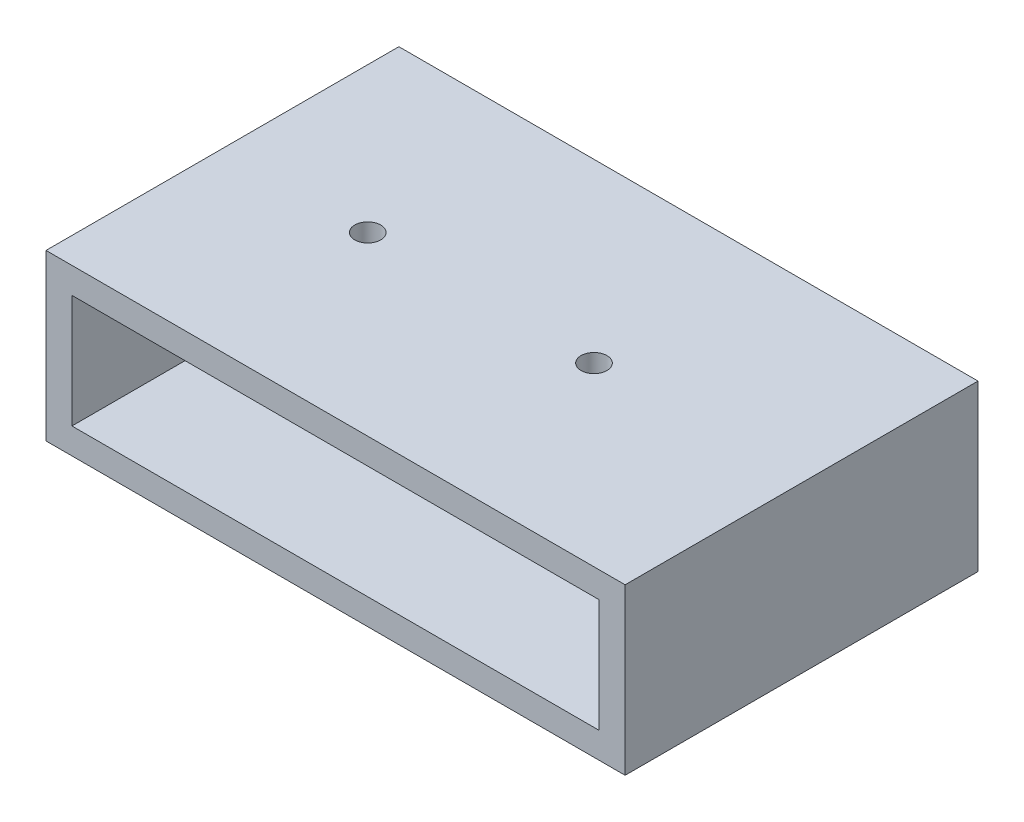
ISO-10303-21;
HEADER;
FILE_DESCRIPTION(('STEP AP214'),'2;1');
FILE_NAME('part.step','',(''),(''),'','','');
FILE_SCHEMA(('AUTOMOTIVE_DESIGN { 1 0 10303 214 1 1 1 1 }'));
ENDSEC;
DATA;
#1=APPLICATION_CONTEXT('core data for automotive mechanical design processes');
#2=APPLICATION_PROTOCOL_DEFINITION('international standard','automotive_design',2000,#1);
#3=PRODUCT_CONTEXT('',#1,'mechanical');
#4=PRODUCT('Part','Part','',(#3));
#5=PRODUCT_RELATED_PRODUCT_CATEGORY('part','',(#4));
#6=PRODUCT_DEFINITION_FORMATION('','',#4);
#7=PRODUCT_DEFINITION_CONTEXT('part definition',#1,'design');
#8=PRODUCT_DEFINITION('design','',#6,#7);
#9=PRODUCT_DEFINITION_SHAPE('','',#8);
#10=(LENGTH_UNIT() NAMED_UNIT(*) SI_UNIT(.MILLI.,.METRE.));
#11=(NAMED_UNIT(*) PLANE_ANGLE_UNIT() SI_UNIT($,.RADIAN.));
#12=(NAMED_UNIT(*) SI_UNIT($,.STERADIAN.) SOLID_ANGLE_UNIT());
#13=UNCERTAINTY_MEASURE_WITH_UNIT(LENGTH_MEASURE(1.E-05),#10,'distance_accuracy_value','');
#14=(GEOMETRIC_REPRESENTATION_CONTEXT(3) GLOBAL_UNCERTAINTY_ASSIGNED_CONTEXT((#13)) GLOBAL_UNIT_ASSIGNED_CONTEXT((#10,
#11,#12)) REPRESENTATION_CONTEXT('',''));
#15=CARTESIAN_POINT('',(0.,0.,0.));
#16=DIRECTION('',(0.,0.,1.));
#17=DIRECTION('',(1.,0.,0.));
#18=AXIS2_PLACEMENT_3D('',#15,#16,#17);
#19=CARTESIAN_POINT('',(0.,3.175,0.));
#20=DIRECTION('',(0.,-1.,0.));
#21=DIRECTION('',(0.,0.,-1.));
#22=AXIS2_PLACEMENT_3D('',#19,#20,#21);
#23=CYLINDRICAL_SURFACE('',#22,1.5875);
#24=CARTESIAN_POINT('',(0.,3.175,0.));
#25=DIRECTION('',(0.,-1.,0.));
#26=DIRECTION('',(1.,0.,0.));
#27=AXIS2_PLACEMENT_3D('',#24,#25,#26);
#28=CIRCLE('',#27,1.5875);
#29=CARTESIAN_POINT('',(1.5875,3.175,0.));
#30=VERTEX_POINT('',#29);
#31=EDGE_CURVE('E132',#30,#30,#28,.T.);
#32=ORIENTED_EDGE('',*,*,#31,.F.);
#33=EDGE_LOOP('',(#32));
#34=FACE_BOUND('',#33,.T.);
#35=CARTESIAN_POINT('',(0.,0.,0.));
#36=DIRECTION('',(0.,1.,0.));
#37=DIRECTION('',(0.,0.,1.));
#38=AXIS2_PLACEMENT_3D('',#35,#36,#37);
#39=CIRCLE('',#38,1.5875);
#40=CARTESIAN_POINT('',(0.,0.,1.5875));
#41=VERTEX_POINT('',#40);
#42=EDGE_CURVE('E158',#41,#41,#39,.T.);
#43=ORIENTED_EDGE('',*,*,#42,.F.);
#44=EDGE_LOOP('',(#43));
#45=FACE_BOUND('',#44,.T.);
#46=ADVANCED_FACE('F33',(#34,#45),#23,.F.);
#47=CARTESIAN_POINT('',(27.686,3.175,0.));
#48=DIRECTION('',(0.,-1.,0.));
#49=DIRECTION('',(0.,0.,-1.));
#50=AXIS2_PLACEMENT_3D('',#47,#48,#49);
#51=CYLINDRICAL_SURFACE('',#50,1.5875);
#52=CARTESIAN_POINT('',(27.686,3.175,0.));
#53=DIRECTION('',(0.,-1.,0.));
#54=DIRECTION('',(1.,0.,0.));
#55=AXIS2_PLACEMENT_3D('',#52,#53,#54);
#56=CIRCLE('',#55,1.5875);
#57=CARTESIAN_POINT('',(29.2735,3.175,0.));
#58=VERTEX_POINT('',#57);
#59=EDGE_CURVE('E131',#58,#58,#56,.T.);
#60=ORIENTED_EDGE('',*,*,#59,.F.);
#61=EDGE_LOOP('',(#60));
#62=FACE_BOUND('',#61,.T.);
#63=CARTESIAN_POINT('',(27.686,0.,0.));
#64=DIRECTION('',(0.,1.,0.));
#65=DIRECTION('',(0.,0.,1.));
#66=AXIS2_PLACEMENT_3D('',#63,#64,#65);
#67=CIRCLE('',#66,1.5875);
#68=CARTESIAN_POINT('',(27.686,0.,1.5875));
#69=VERTEX_POINT('',#68);
#70=EDGE_CURVE('E155',#69,#69,#67,.T.);
#71=ORIENTED_EDGE('',*,*,#70,.F.);
#72=EDGE_LOOP('',(#71));
#73=FACE_BOUND('',#72,.T.);
#74=ADVANCED_FACE('F205',(#62,#73),#51,.F.);
#75=CARTESIAN_POINT('',(-17.78,0.,21.59));
#76=DIRECTION('',(0.,1.,0.));
#77=DIRECTION('',(0.,0.,1.));
#78=AXIS2_PLACEMENT_3D('',#75,#76,#77);
#79=PLANE('',#78);
#80=ORIENTED_EDGE('',*,*,#42,.T.);
#81=EDGE_LOOP('',(#80));
#82=FACE_BOUND('',#81,.T.);
#83=DIRECTION('',(0.,0.,1.));
#84=VECTOR('',#83,1.);
#85=CARTESIAN_POINT('',(-17.78,0.,0.));
#86=LINE('',#85,#84);
#87=CARTESIAN_POINT('',(-17.78,0.,-21.59));
#88=VERTEX_POINT('',#87);
#89=CARTESIAN_POINT('',(-17.78,0.,21.59));
#90=VERTEX_POINT('',#89);
#91=EDGE_CURVE('E161',#88,#90,#86,.T.);
#92=ORIENTED_EDGE('',*,*,#91,.F.);
#93=DIRECTION('',(-1.,0.,0.));
#94=VECTOR('',#93,1.);
#95=CARTESIAN_POINT('',(53.086,0.,-21.59));
#96=LINE('',#95,#94);
#97=CARTESIAN_POINT('',(53.086,0.,-21.59));
#98=VERTEX_POINT('',#97);
#99=EDGE_CURVE('E170',#98,#88,#96,.T.);
#100=ORIENTED_EDGE('',*,*,#99,.F.);
#101=DIRECTION('',(0.,0.,-1.));
#102=VECTOR('',#101,1.);
#103=CARTESIAN_POINT('',(53.086,0.,0.));
#104=LINE('',#103,#102);
#105=CARTESIAN_POINT('',(53.086,0.,21.59));
#106=VERTEX_POINT('',#105);
#107=EDGE_CURVE('E167',#106,#98,#104,.T.);
#108=ORIENTED_EDGE('',*,*,#107,.F.);
#109=DIRECTION('',(1.,0.,0.));
#110=VECTOR('',#109,1.);
#111=CARTESIAN_POINT('',(-17.78,0.,21.59));
#112=LINE('',#111,#110);
#113=EDGE_CURVE('E164',#90,#106,#112,.T.);
#114=ORIENTED_EDGE('',*,*,#113,.F.);
#115=EDGE_LOOP('',(#92,#100,#108,#114));
#116=FACE_BOUND('',#115,.T.);
#117=ORIENTED_EDGE('',*,*,#70,.T.);
#118=EDGE_LOOP('',(#117));
#119=FACE_BOUND('',#118,.T.);
#120=ADVANCED_FACE('F213',(#82,#116,#119),#79,.F.);
#121=CARTESIAN_POINT('',(-17.78,3.175,0.));
#122=DIRECTION('',(1.,0.,0.));
#123=DIRECTION('',(0.,0.,-1.));
#124=AXIS2_PLACEMENT_3D('',#121,#122,#123);
#125=PLANE('',#124);
#126=ORIENTED_EDGE('',*,*,#91,.T.);
#127=DIRECTION('',(0.,-1.,0.));
#128=VECTOR('',#127,1.);
#129=CARTESIAN_POINT('',(-17.78,3.175,21.59));
#130=LINE('',#129,#128);
#131=CARTESIAN_POINT('',(-17.78,20.193,21.59));
#132=VERTEX_POINT('',#131);
#133=EDGE_CURVE('E179',#132,#90,#130,.T.);
#134=ORIENTED_EDGE('',*,*,#133,.F.);
#135=DIRECTION('',(0.,0.,1.));
#136=VECTOR('',#135,1.);
#137=CARTESIAN_POINT('',(-17.78,20.193,21.59));
#138=LINE('',#137,#136);
#139=CARTESIAN_POINT('',(-17.78,20.193,-21.59));
#140=VERTEX_POINT('',#139);
#141=EDGE_CURVE('E147',#140,#132,#138,.T.);
#142=ORIENTED_EDGE('',*,*,#141,.F.);
#143=DIRECTION('',(0.,-1.,0.));
#144=VECTOR('',#143,1.);
#145=CARTESIAN_POINT('',(-17.78,3.175,-21.59));
#146=LINE('',#145,#144);
#147=EDGE_CURVE('E173',#140,#88,#146,.T.);
#148=ORIENTED_EDGE('',*,*,#147,.T.);
#149=EDGE_LOOP('',(#126,#134,#142,#148));
#150=FACE_BOUND('',#149,.T.);
#151=ADVANCED_FACE('F35',(#150),#125,.F.);
#152=CARTESIAN_POINT('',(-17.78,3.175,21.59));
#153=DIRECTION('',(0.,0.,-1.));
#154=DIRECTION('',(-1.,0.,0.));
#155=AXIS2_PLACEMENT_3D('',#152,#153,#154);
#156=PLANE('',#155);
#157=DIRECTION('',(0.,1.,0.));
#158=VECTOR('',#157,1.);
#159=CARTESIAN_POINT('',(49.911,17.018,21.59));
#160=LINE('',#159,#158);
#161=CARTESIAN_POINT('',(49.911,3.175,21.59));
#162=VERTEX_POINT('',#161);
#163=CARTESIAN_POINT('',(49.911,17.018,21.59));
#164=VERTEX_POINT('',#163);
#165=EDGE_CURVE('E110',#162,#164,#160,.T.);
#166=ORIENTED_EDGE('',*,*,#165,.F.);
#167=DIRECTION('',(1.,0.,0.));
#168=VECTOR('',#167,1.);
#169=CARTESIAN_POINT('',(17.653,3.175,21.59));
#170=LINE('',#169,#168);
#171=CARTESIAN_POINT('',(-14.605,3.175,21.59));
#172=VERTEX_POINT('',#171);
#173=EDGE_CURVE('E48',#172,#162,#170,.T.);
#174=ORIENTED_EDGE('',*,*,#173,.F.);
#175=DIRECTION('',(0.,-1.,0.));
#176=VECTOR('',#175,1.);
#177=CARTESIAN_POINT('',(-14.605,17.018,21.59));
#178=LINE('',#177,#176);
#179=CARTESIAN_POINT('',(-14.605,17.018,21.59));
#180=VERTEX_POINT('',#179);
#181=EDGE_CURVE('E117',#180,#172,#178,.T.);
#182=ORIENTED_EDGE('',*,*,#181,.F.);
#183=DIRECTION('',(-1.,0.,0.));
#184=VECTOR('',#183,1.);
#185=CARTESIAN_POINT('',(13.8115890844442,17.018,21.59));
#186=LINE('',#185,#184);
#187=EDGE_CURVE('E101',#164,#180,#186,.T.);
#188=ORIENTED_EDGE('',*,*,#187,.F.);
#189=EDGE_LOOP('',(#166,#174,#182,#188));
#190=FACE_BOUND('',#189,.T.);
#191=ORIENTED_EDGE('',*,*,#113,.T.);
#192=DIRECTION('',(0.,-1.,0.));
#193=VECTOR('',#192,1.);
#194=CARTESIAN_POINT('',(53.086,3.175,21.59));
#195=LINE('',#194,#193);
#196=CARTESIAN_POINT('',(53.086,20.193,21.59));
#197=VERTEX_POINT('',#196);
#198=EDGE_CURVE('E177',#197,#106,#195,.T.);
#199=ORIENTED_EDGE('',*,*,#198,.F.);
#200=DIRECTION('',(1.,0.,0.));
#201=VECTOR('',#200,1.);
#202=CARTESIAN_POINT('',(-14.605,20.193,21.59));
#203=LINE('',#202,#201);
#204=EDGE_CURVE('E150',#132,#197,#203,.T.);
#205=ORIENTED_EDGE('',*,*,#204,.F.);
#206=ORIENTED_EDGE('',*,*,#133,.T.);
#207=EDGE_LOOP('',(#191,#199,#205,#206));
#208=FACE_BOUND('',#207,.T.);
#209=ADVANCED_FACE('F114',(#190,#208),#156,.F.);
#210=CARTESIAN_POINT('',(53.086,3.175,0.));
#211=DIRECTION('',(-1.,0.,0.));
#212=DIRECTION('',(0.,0.,1.));
#213=AXIS2_PLACEMENT_3D('',#210,#211,#212);
#214=PLANE('',#213);
#215=ORIENTED_EDGE('',*,*,#107,.T.);
#216=DIRECTION('',(0.,-1.,0.));
#217=VECTOR('',#216,1.);
#218=CARTESIAN_POINT('',(53.086,3.175,-21.59));
#219=LINE('',#218,#217);
#220=CARTESIAN_POINT('',(53.086,20.193,-21.59));
#221=VERTEX_POINT('',#220);
#222=EDGE_CURVE('E175',#221,#98,#219,.T.);
#223=ORIENTED_EDGE('',*,*,#222,.F.);
#224=DIRECTION('',(0.,0.,-1.));
#225=VECTOR('',#224,1.);
#226=CARTESIAN_POINT('',(53.086,20.193,21.59));
#227=LINE('',#226,#225);
#228=EDGE_CURVE('E144',#197,#221,#227,.T.);
#229=ORIENTED_EDGE('',*,*,#228,.F.);
#230=ORIENTED_EDGE('',*,*,#198,.T.);
#231=EDGE_LOOP('',(#215,#223,#229,#230));
#232=FACE_BOUND('',#231,.T.);
#233=ADVANCED_FACE('F226',(#232),#214,.F.);
#234=CARTESIAN_POINT('',(53.086,3.175,-21.59));
#235=DIRECTION('',(0.,0.,1.));
#236=DIRECTION('',(1.,0.,0.));
#237=AXIS2_PLACEMENT_3D('',#234,#235,#236);
#238=PLANE('',#237);
#239=DIRECTION('',(0.,-1.,0.));
#240=VECTOR('',#239,1.);
#241=CARTESIAN_POINT('',(-14.605,3.175,-21.59));
#242=LINE('',#241,#240);
#243=CARTESIAN_POINT('',(-14.605,17.018,-21.59));
#244=VERTEX_POINT('',#243);
#245=CARTESIAN_POINT('',(-14.605,3.175,-21.59));
#246=VERTEX_POINT('',#245);
#247=EDGE_CURVE('E11',#244,#246,#242,.T.);
#248=ORIENTED_EDGE('',*,*,#247,.T.);
#249=DIRECTION('',(1.,0.,0.));
#250=VECTOR('',#249,1.);
#251=CARTESIAN_POINT('',(53.086,3.175,-21.59));
#252=LINE('',#251,#250);
#253=CARTESIAN_POINT('',(49.911,3.175,-21.59));
#254=VERTEX_POINT('',#253);
#255=EDGE_CURVE('E135',#246,#254,#252,.T.);
#256=ORIENTED_EDGE('',*,*,#255,.T.);
#257=DIRECTION('',(0.,1.,0.));
#258=VECTOR('',#257,1.);
#259=CARTESIAN_POINT('',(49.911,3.175,-21.59));
#260=LINE('',#259,#258);
#261=CARTESIAN_POINT('',(49.911,17.018,-21.59));
#262=VERTEX_POINT('',#261);
#263=EDGE_CURVE('E41',#254,#262,#260,.T.);
#264=ORIENTED_EDGE('',*,*,#263,.T.);
#265=DIRECTION('',(-1.,0.,0.));
#266=VECTOR('',#265,1.);
#267=CARTESIAN_POINT('',(53.086,17.018,-21.59));
#268=LINE('',#267,#266);
#269=EDGE_CURVE('E104',#262,#244,#268,.T.);
#270=ORIENTED_EDGE('',*,*,#269,.T.);
#271=EDGE_LOOP('',(#248,#256,#264,#270));
#272=FACE_BOUND('',#271,.T.);
#273=ORIENTED_EDGE('',*,*,#99,.T.);
#274=ORIENTED_EDGE('',*,*,#147,.F.);
#275=DIRECTION('',(-1.,0.,0.));
#276=VECTOR('',#275,1.);
#277=CARTESIAN_POINT('',(-17.78,20.193,-21.59));
#278=LINE('',#277,#276);
#279=EDGE_CURVE('E152',#221,#140,#278,.T.);
#280=ORIENTED_EDGE('',*,*,#279,.F.);
#281=ORIENTED_EDGE('',*,*,#222,.T.);
#282=EDGE_LOOP('',(#273,#274,#280,#281));
#283=FACE_BOUND('',#282,.T.);
#284=ADVANCED_FACE('F185',(#272,#283),#238,.F.);
#285=CARTESIAN_POINT('',(0.,17.018,0.));
#286=DIRECTION('',(0.,1.,0.));
#287=DIRECTION('',(0.,0.,1.));
#288=AXIS2_PLACEMENT_3D('',#285,#286,#287);
#289=CIRCLE('',#288,1.5875);
#290=CARTESIAN_POINT('',(0.,17.018,1.5875));
#291=VERTEX_POINT('',#290);
#292=EDGE_CURVE('E127',#291,#291,#289,.T.);
#293=ORIENTED_EDGE('',*,*,#292,.F.);
#294=EDGE_LOOP('',(#293));
#295=FACE_BOUND('',#294,.T.);
#296=CARTESIAN_POINT('',(0.,20.193,0.));
#297=DIRECTION('',(0.,-1.,0.));
#298=DIRECTION('',(0.,0.,-1.));
#299=AXIS2_PLACEMENT_3D('',#296,#297,#298);
#300=CIRCLE('',#299,1.5875);
#301=CARTESIAN_POINT('',(0.,20.193,-1.5875));
#302=VERTEX_POINT('',#301);
#303=EDGE_CURVE('E141',#302,#302,#300,.T.);
#304=ORIENTED_EDGE('',*,*,#303,.F.);
#305=EDGE_LOOP('',(#304));
#306=FACE_BOUND('',#305,.T.);
#307=ADVANCED_FACE('F208',(#295,#306),#23,.F.);
#308=CARTESIAN_POINT('',(27.686,17.018,0.));
#309=DIRECTION('',(0.,1.,0.));
#310=DIRECTION('',(0.,0.,1.));
#311=AXIS2_PLACEMENT_3D('',#308,#309,#310);
#312=CIRCLE('',#311,1.5875);
#313=CARTESIAN_POINT('',(27.686,17.018,1.5875));
#314=VERTEX_POINT('',#313);
#315=EDGE_CURVE('E124',#314,#314,#312,.T.);
#316=ORIENTED_EDGE('',*,*,#315,.F.);
#317=EDGE_LOOP('',(#316));
#318=FACE_BOUND('',#317,.T.);
#319=CARTESIAN_POINT('',(27.686,20.193,0.));
#320=DIRECTION('',(0.,-1.,0.));
#321=DIRECTION('',(0.,0.,-1.));
#322=AXIS2_PLACEMENT_3D('',#319,#320,#321);
#323=CIRCLE('',#322,1.5875);
#324=CARTESIAN_POINT('',(27.686,20.193,-1.5875));
#325=VERTEX_POINT('',#324);
#326=EDGE_CURVE('E138',#325,#325,#323,.T.);
#327=ORIENTED_EDGE('',*,*,#326,.F.);
#328=EDGE_LOOP('',(#327));
#329=FACE_BOUND('',#328,.T.);
#330=ADVANCED_FACE('F199',(#318,#329),#51,.F.);
#331=CARTESIAN_POINT('',(-17.78,20.193,-21.59));
#332=DIRECTION('',(0.,-1.,0.));
#333=DIRECTION('',(0.,0.,-1.));
#334=AXIS2_PLACEMENT_3D('',#331,#332,#333);
#335=PLANE('',#334);
#336=ORIENTED_EDGE('',*,*,#326,.T.);
#337=EDGE_LOOP('',(#336));
#338=FACE_BOUND('',#337,.T.);
#339=ORIENTED_EDGE('',*,*,#303,.T.);
#340=EDGE_LOOP('',(#339));
#341=FACE_BOUND('',#340,.T.);
#342=ORIENTED_EDGE('',*,*,#141,.T.);
#343=ORIENTED_EDGE('',*,*,#204,.T.);
#344=ORIENTED_EDGE('',*,*,#228,.T.);
#345=ORIENTED_EDGE('',*,*,#279,.T.);
#346=EDGE_LOOP('',(#342,#343,#344,#345));
#347=FACE_BOUND('',#346,.T.);
#348=ADVANCED_FACE('F192',(#338,#341,#347),#335,.F.);
#349=CARTESIAN_POINT('',(-14.605,17.018,-26.416));
#350=DIRECTION('',(-1.,0.,0.));
#351=DIRECTION('',(0.,0.,1.));
#352=AXIS2_PLACEMENT_3D('',#349,#350,#351);
#353=PLANE('',#352);
#354=DIRECTION('',(0.,0.,1.));
#355=VECTOR('',#354,1.);
#356=CARTESIAN_POINT('',(-14.605,17.018,-26.416));
#357=LINE('',#356,#355);
#358=EDGE_CURVE('E106',#244,#180,#357,.T.);
#359=ORIENTED_EDGE('',*,*,#358,.T.);
#360=ORIENTED_EDGE('',*,*,#181,.T.);
#361=DIRECTION('',(0.,0.,1.));
#362=VECTOR('',#361,1.);
#363=CARTESIAN_POINT('',(-14.605,3.175,-26.416));
#364=LINE('',#363,#362);
#365=EDGE_CURVE('E122',#246,#172,#364,.T.);
#366=ORIENTED_EDGE('',*,*,#365,.F.);
#367=ORIENTED_EDGE('',*,*,#247,.F.);
#368=EDGE_LOOP('',(#359,#360,#366,#367));
#369=FACE_BOUND('',#368,.T.);
#370=ADVANCED_FACE('F190',(#369),#353,.F.);
#371=CARTESIAN_POINT('',(49.911,17.018,-26.416));
#372=DIRECTION('',(1.,0.,0.));
#373=DIRECTION('',(0.,0.,-1.));
#374=AXIS2_PLACEMENT_3D('',#371,#372,#373);
#375=PLANE('',#374);
#376=DIRECTION('',(0.,0.,1.));
#377=VECTOR('',#376,1.);
#378=CARTESIAN_POINT('',(49.911,3.175,-26.416));
#379=LINE('',#378,#377);
#380=EDGE_CURVE('E107',#254,#162,#379,.T.);
#381=ORIENTED_EDGE('',*,*,#380,.T.);
#382=ORIENTED_EDGE('',*,*,#165,.T.);
#383=DIRECTION('',(0.,0.,1.));
#384=VECTOR('',#383,1.);
#385=CARTESIAN_POINT('',(49.911,17.018,-26.416));
#386=LINE('',#385,#384);
#387=EDGE_CURVE('E56',#262,#164,#386,.T.);
#388=ORIENTED_EDGE('',*,*,#387,.F.);
#389=ORIENTED_EDGE('',*,*,#263,.F.);
#390=EDGE_LOOP('',(#381,#382,#388,#389));
#391=FACE_BOUND('',#390,.T.);
#392=ADVANCED_FACE('F111',(#391),#375,.F.);
#393=CARTESIAN_POINT('',(17.653,3.175,-26.416));
#394=DIRECTION('',(0.,-1.,0.));
#395=DIRECTION('',(1.,0.,0.));
#396=AXIS2_PLACEMENT_3D('',#393,#394,#395);
#397=PLANE('',#396);
#398=ORIENTED_EDGE('',*,*,#59,.T.);
#399=EDGE_LOOP('',(#398));
#400=FACE_BOUND('',#399,.T.);
#401=ORIENTED_EDGE('',*,*,#31,.T.);
#402=EDGE_LOOP('',(#401));
#403=FACE_BOUND('',#402,.T.);
#404=ORIENTED_EDGE('',*,*,#365,.T.);
#405=ORIENTED_EDGE('',*,*,#173,.T.);
#406=ORIENTED_EDGE('',*,*,#380,.F.);
#407=ORIENTED_EDGE('',*,*,#255,.F.);
#408=EDGE_LOOP('',(#404,#405,#406,#407));
#409=FACE_BOUND('',#408,.T.);
#410=ADVANCED_FACE('F187',(#400,#403,#409),#397,.F.);
#411=CARTESIAN_POINT('',(13.8115890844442,17.018,-26.416));
#412=DIRECTION('',(0.,1.,0.));
#413=DIRECTION('',(0.,0.,1.));
#414=AXIS2_PLACEMENT_3D('',#411,#412,#413);
#415=PLANE('',#414);
#416=ORIENTED_EDGE('',*,*,#315,.T.);
#417=EDGE_LOOP('',(#416));
#418=FACE_BOUND('',#417,.T.);
#419=ORIENTED_EDGE('',*,*,#292,.T.);
#420=EDGE_LOOP('',(#419));
#421=FACE_BOUND('',#420,.T.);
#422=ORIENTED_EDGE('',*,*,#387,.T.);
#423=ORIENTED_EDGE('',*,*,#187,.T.);
#424=ORIENTED_EDGE('',*,*,#358,.F.);
#425=ORIENTED_EDGE('',*,*,#269,.F.);
#426=EDGE_LOOP('',(#422,#423,#424,#425));
#427=FACE_BOUND('',#426,.T.);
#428=ADVANCED_FACE('F98',(#418,#421,#427),#415,.F.);
#429=CLOSED_SHELL('',(#46,#74,#120,#151,#209,#233,#284,#307,#330,#348,#370,#392,#410,#428));
#430=MANIFOLD_SOLID_BREP('B2',#429);
#431=ADVANCED_BREP_SHAPE_REPRESENTATION('',(#18,#430),#14);
#432=SHAPE_DEFINITION_REPRESENTATION(#9,#431);
ENDSEC;
END-ISO-10303-21;
